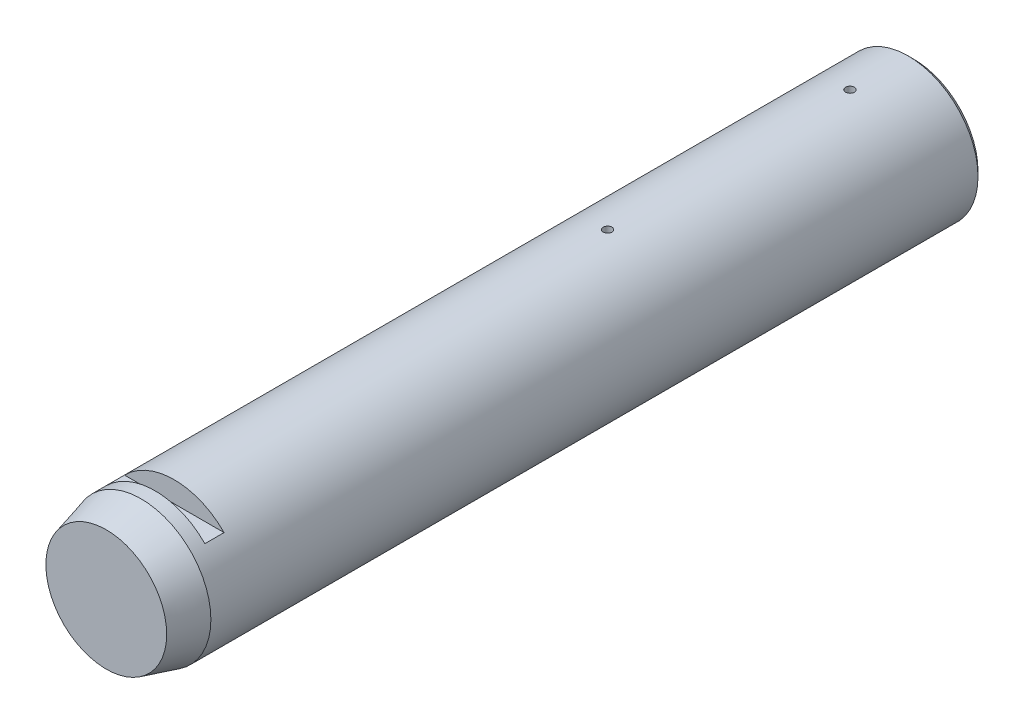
ISO-10303-21;
HEADER;
FILE_DESCRIPTION(('STEP AP214'),'2;1');
FILE_NAME('part.step','',(''),(''),'','','');
FILE_SCHEMA(('AUTOMOTIVE_DESIGN { 1 0 10303 214 1 1 1 1 }'));
ENDSEC;
DATA;
#1=APPLICATION_CONTEXT('core data for automotive mechanical design processes');
#2=APPLICATION_PROTOCOL_DEFINITION('international standard','automotive_design',2000,#1);
#3=PRODUCT_CONTEXT('',#1,'mechanical');
#4=PRODUCT('Part','Part','',(#3));
#5=PRODUCT_RELATED_PRODUCT_CATEGORY('part','',(#4));
#6=PRODUCT_DEFINITION_FORMATION('','',#4);
#7=PRODUCT_DEFINITION_CONTEXT('part definition',#1,'design');
#8=PRODUCT_DEFINITION('design','',#6,#7);
#9=PRODUCT_DEFINITION_SHAPE('','',#8);
#10=(LENGTH_UNIT() NAMED_UNIT(*) SI_UNIT(.MILLI.,.METRE.));
#11=(NAMED_UNIT(*) PLANE_ANGLE_UNIT() SI_UNIT($,.RADIAN.));
#12=(NAMED_UNIT(*) SI_UNIT($,.STERADIAN.) SOLID_ANGLE_UNIT());
#13=UNCERTAINTY_MEASURE_WITH_UNIT(LENGTH_MEASURE(1.E-05),#10,'distance_accuracy_value','');
#14=(GEOMETRIC_REPRESENTATION_CONTEXT(3) GLOBAL_UNCERTAINTY_ASSIGNED_CONTEXT((#13)) GLOBAL_UNIT_ASSIGNED_CONTEXT((#10,
#11,#12)) REPRESENTATION_CONTEXT('',''));
#15=CARTESIAN_POINT('',(0.,0.,0.));
#16=DIRECTION('',(0.,0.,1.));
#17=DIRECTION('',(1.,0.,0.));
#18=AXIS2_PLACEMENT_3D('',#15,#16,#17);
#19=CARTESIAN_POINT('',(0.,0.,463.));
#20=DIRECTION('',(0.,0.,-1.));
#21=DIRECTION('',(-1.,0.,0.));
#22=AXIS2_PLACEMENT_3D('',#19,#20,#21);
#23=CYLINDRICAL_SURFACE('',#22,40.);
#24=CARTESIAN_POINT('',(0.,0.,2.99999999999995));
#25=DIRECTION('',(0.,0.,1.));
#26=DIRECTION('',(1.,0.,0.));
#27=AXIS2_PLACEMENT_3D('',#24,#25,#26);
#28=CIRCLE('',#27,40.);
#29=CARTESIAN_POINT('',(40.,0.,2.99999999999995));
#30=VERTEX_POINT('',#29);
#31=EDGE_CURVE('E93',#30,#30,#28,.T.);
#32=ORIENTED_EDGE('',*,*,#31,.T.);
#33=EDGE_LOOP('',(#32));
#34=FACE_BOUND('',#33,.T.);
#35=CARTESIAN_POINT('',(0.,0.,443.));
#36=DIRECTION('',(0.,0.,1.));
#37=DIRECTION('',(1.,0.,0.));
#38=AXIS2_PLACEMENT_3D('',#35,#36,#37);
#39=CIRCLE('',#38,40.);
#40=CARTESIAN_POINT('',(40.,0.,443.));
#41=VERTEX_POINT('',#40);
#42=EDGE_CURVE('E84',#41,#41,#39,.F.);
#43=ORIENTED_EDGE('',*,*,#42,.T.);
#44=EDGE_LOOP('',(#43));
#45=FACE_BOUND('',#44,.T.);
#46=CARTESIAN_POINT('',(0.,40.,39.));
#47=CARTESIAN_POINT('',(0.140279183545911,39.9999989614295,38.9999938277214));
#48=CARTESIAN_POINT('',(0.280656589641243,39.999254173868,38.9881533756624));
#49=CARTESIAN_POINT('',(0.557535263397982,39.9963546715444,38.9410894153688));
#50=CARTESIAN_POINT('',(0.694031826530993,39.9941983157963,38.9058386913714));
#51=CARTESIAN_POINT('',(0.959098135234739,39.9887196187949,38.8129706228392));
#52=CARTESIAN_POINT('',(1.0876720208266,39.9853978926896,38.7553650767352));
#53=CARTESIAN_POINT('',(1.33329176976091,39.9779620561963,38.6194416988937));
#54=CARTESIAN_POINT('',(1.45034026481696,39.9738481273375,38.5411286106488));
#55=CARTESIAN_POINT('',(1.66979557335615,39.9652834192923,38.3658846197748));
#56=CARTESIAN_POINT('',(1.77218285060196,39.9608322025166,38.2689292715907));
#57=CARTESIAN_POINT('',(1.95924226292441,39.9520983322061,38.0592033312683));
#58=CARTESIAN_POINT('',(2.04391365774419,39.9478156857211,37.9464320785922));
#59=CARTESIAN_POINT('',(2.19319796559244,39.9398985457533,37.7081648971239));
#60=CARTESIAN_POINT('',(2.25779465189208,39.9362645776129,37.5826587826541));
#61=CARTESIAN_POINT('',(2.36499204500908,39.9300602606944,37.3225559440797));
#62=CARTESIAN_POINT('',(2.4075929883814,39.9274899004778,37.1879593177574));
#63=CARTESIAN_POINT('',(2.46953539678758,39.9237068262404,36.9136843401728));
#64=CARTESIAN_POINT('',(2.48890746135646,39.922492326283,36.774012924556));
#65=CARTESIAN_POINT('',(2.50393666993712,39.9215525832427,36.4933959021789));
#66=CARTESIAN_POINT('',(2.49959408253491,39.921827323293,36.3524503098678));
#67=CARTESIAN_POINT('',(2.46734265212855,39.923833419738,36.0734943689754));
#68=CARTESIAN_POINT('',(2.43946692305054,39.925562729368,35.9354801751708));
#69=CARTESIAN_POINT('',(2.36099186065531,39.9302798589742,35.666093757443));
#70=CARTESIAN_POINT('',(2.31039239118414,39.933267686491,35.5347215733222));
#71=CARTESIAN_POINT('',(2.18786859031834,39.9401674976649,35.2822419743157));
#72=CARTESIAN_POINT('',(2.11592923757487,39.9440801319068,35.1611418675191));
#73=CARTESIAN_POINT('',(1.95277865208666,39.9523879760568,34.9327239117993));
#74=CARTESIAN_POINT('',(1.8615672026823,39.9567831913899,34.8254062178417));
#75=CARTESIAN_POINT('',(1.66227507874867,39.9655699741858,34.6274067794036));
#76=CARTESIAN_POINT('',(1.55416574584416,39.9699615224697,34.5367538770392));
#77=CARTESIAN_POINT('',(1.32424715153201,39.9782388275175,34.3748797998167));
#78=CARTESIAN_POINT('',(1.20243788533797,39.9821245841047,34.3036586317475));
#79=CARTESIAN_POINT('',(0.948559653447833,39.9889527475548,34.1826721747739));
#80=CARTESIAN_POINT('',(0.816490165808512,39.9918951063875,34.1329079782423));
#81=CARTESIAN_POINT('',(0.545848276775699,39.9965042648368,34.0562673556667));
#82=CARTESIAN_POINT('',(0.407275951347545,39.9981710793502,34.0293906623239));
#83=CARTESIAN_POINT('',(0.127812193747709,40.0000394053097,33.9993237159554));
#84=CARTESIAN_POINT('',(-0.013074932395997,40.0002433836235,33.9960935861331));
#85=CARTESIAN_POINT('',(-0.29338901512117,39.999169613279,34.0133072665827));
#86=CARTESIAN_POINT('',(-0.43281597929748,39.9978918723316,34.0337509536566));
#87=CARTESIAN_POINT('',(-0.706139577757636,39.994000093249,34.0976989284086));
#88=CARTESIAN_POINT('',(-0.840040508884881,39.9913871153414,34.1411849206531));
#89=CARTESIAN_POINT('',(-1.09864370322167,39.985118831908,34.2499645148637));
#90=CARTESIAN_POINT('',(-1.22334588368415,39.9814635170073,34.3152583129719));
#91=CARTESIAN_POINT('',(-1.46019434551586,39.9735151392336,34.4659015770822));
#92=CARTESIAN_POINT('',(-1.5723236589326,39.9692212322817,34.551277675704));
#93=CARTESIAN_POINT('',(-1.78067263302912,39.9604817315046,34.7396232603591));
#94=CARTESIAN_POINT('',(-1.87689213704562,39.9560361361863,34.8425929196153));
#95=CARTESIAN_POINT('',(-2.05082525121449,39.9474871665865,35.0633747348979));
#96=CARTESIAN_POINT('',(-2.12851299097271,39.9433842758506,35.1812072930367));
#97=CARTESIAN_POINT('',(-2.26300034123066,39.9359911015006,35.4282675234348));
#98=CARTESIAN_POINT('',(-2.3198000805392,39.9327008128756,35.5574951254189));
#99=CARTESIAN_POINT('',(-2.41085429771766,39.9273073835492,35.8235826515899));
#100=CARTESIAN_POINT('',(-2.44512505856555,39.9252033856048,35.9604369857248));
#101=CARTESIAN_POINT('',(-2.49020167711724,39.9224174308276,36.2379708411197));
#102=CARTESIAN_POINT('',(-2.50100776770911,39.9217354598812,36.3786503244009));
#103=CARTESIAN_POINT('',(-2.49884605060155,39.9218708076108,36.6595838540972));
#104=CARTESIAN_POINT('',(-2.48591891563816,39.9226855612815,36.7998382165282));
#105=CARTESIAN_POINT('',(-2.43674202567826,39.9257171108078,37.0761807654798));
#106=CARTESIAN_POINT('',(-2.4004922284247,39.9279339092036,37.2122689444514));
#107=CARTESIAN_POINT('',(-2.30570815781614,39.9335191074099,37.4764222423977));
#108=CARTESIAN_POINT('',(-2.24717404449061,39.9368874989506,37.60448741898));
#109=CARTESIAN_POINT('',(-2.10948852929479,39.9443962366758,37.8489777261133));
#110=CARTESIAN_POINT('',(-2.03033766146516,39.9485365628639,37.9654031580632));
#111=CARTESIAN_POINT('',(-1.85351514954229,39.9571308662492,38.1835152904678));
#112=CARTESIAN_POINT('',(-1.75581411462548,39.9615853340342,38.2851781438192));
#113=CARTESIAN_POINT('',(-1.54470387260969,39.97030180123,38.4706947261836));
#114=CARTESIAN_POINT('',(-1.43129082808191,39.9745637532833,38.5545440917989));
#115=CARTESIAN_POINT('',(-1.19184681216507,39.9824193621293,38.7021152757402));
#116=CARTESIAN_POINT('',(-1.06580040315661,39.9860121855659,38.765812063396));
#117=CARTESIAN_POINT('',(-0.804871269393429,39.992113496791,38.8710605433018));
#118=CARTESIAN_POINT('',(-0.669999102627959,39.9946232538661,38.9126381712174));
#119=CARTESIAN_POINT('',(-0.445251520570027,39.9976179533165,38.9616618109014));
#120=CARTESIAN_POINT('',(-0.356828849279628,39.9985072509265,38.9760200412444));
#121=CARTESIAN_POINT('',(-0.17895077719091,39.9996986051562,38.9951910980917));
#122=CARTESIAN_POINT('',(-0.0894953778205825,40.0000006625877,39.0000039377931));
#123=CARTESIAN_POINT('',(0.,40.,39.));
#124=B_SPLINE_CURVE_WITH_KNOTS('',3,(#46,#47,#48,#49,#50,#51,#52,#53,#54,#55,#56,#57,#58,#59,
#60,#61,#62,#63,#64,#65,#66,#67,#68,#69,#70,#71,#72,#73,#74,#75,#76,#77,#78,#79,#80,#81,#82,#83,
#84,#85,#86,#87,#88,#89,#90,#91,#92,#93,#94,#95,#96,#97,#98,#99,#100,#101,#102,#103,#104,#105,
#106,#107,#108,#109,#110,#111,#112,#113,#114,#115,#116,#117,#118,#119,#120,#121,#122,#123),
.UNSPECIFIED.,.T.,.F.,(4,2,2,2,2,2,2,2,2,2,2,2,2,2,2,2,2,2,2,2,2,2,2,2,2,2,2,2,2,2,2,2,2,2,2,2,
2,2,4),(0.,0.420510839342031,0.841511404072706,1.26229007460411,1.68297244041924,
2.10421025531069,2.52546566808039,2.94706070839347,3.36865121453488,3.78968574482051,
4.21071550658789,4.63115381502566,5.05159464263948,5.47233212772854,5.89307434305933,
6.3145380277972,6.73600185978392,7.15748714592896,7.57896750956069,7.99973693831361,
8.42050417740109,8.84093782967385,9.26137526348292,9.68237344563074,10.1033757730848,
10.5249624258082,10.9465464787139,11.3678254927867,11.7891003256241,12.2096538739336,
12.630208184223,13.0507594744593,13.4712998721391,13.8925122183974,14.3138276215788,
14.7356642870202,15.1570052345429,15.4252833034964,15.6935610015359),.UNSPECIFIED.);
#125=CARTESIAN_POINT('',(0.,40.,39.));
#126=VERTEX_POINT('',#125);
#127=EDGE_CURVE('E114',#126,#126,#124,.T.);
#128=ORIENTED_EDGE('',*,*,#127,.F.);
#129=EDGE_LOOP('',(#128));
#130=FACE_BOUND('',#129,.T.);
#131=CARTESIAN_POINT('',(0.,40.,178.));
#132=CARTESIAN_POINT('',(0.140279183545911,39.9999989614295,177.999993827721));
#133=CARTESIAN_POINT('',(0.280656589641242,39.999254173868,177.988153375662));
#134=CARTESIAN_POINT('',(0.55753526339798,39.9963546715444,177.941089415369));
#135=CARTESIAN_POINT('',(0.694031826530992,39.9941983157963,177.905838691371));
#136=CARTESIAN_POINT('',(0.959098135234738,39.9887196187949,177.812970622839));
#137=CARTESIAN_POINT('',(1.0876720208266,39.9853978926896,177.755365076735));
#138=CARTESIAN_POINT('',(1.33329176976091,39.9779620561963,177.619441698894));
#139=CARTESIAN_POINT('',(1.45034026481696,39.9738481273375,177.541128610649));
#140=CARTESIAN_POINT('',(1.66979557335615,39.9652834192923,177.365884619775));
#141=CARTESIAN_POINT('',(1.77218285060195,39.9608322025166,177.268929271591));
#142=CARTESIAN_POINT('',(1.9592422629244,39.9520983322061,177.059203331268));
#143=CARTESIAN_POINT('',(2.04391365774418,39.9478156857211,176.946432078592));
#144=CARTESIAN_POINT('',(2.19319796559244,39.9398985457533,176.708164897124));
#145=CARTESIAN_POINT('',(2.25779465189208,39.9362645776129,176.582658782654));
#146=CARTESIAN_POINT('',(2.36499204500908,39.9300602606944,176.32255594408));
#147=CARTESIAN_POINT('',(2.4075929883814,39.9274899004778,176.187959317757));
#148=CARTESIAN_POINT('',(2.46953539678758,39.9237068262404,175.913684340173));
#149=CARTESIAN_POINT('',(2.48890746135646,39.922492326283,175.774012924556));
#150=CARTESIAN_POINT('',(2.50393666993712,39.9215525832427,175.493395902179));
#151=CARTESIAN_POINT('',(2.4995940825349,39.921827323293,175.352450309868));
#152=CARTESIAN_POINT('',(2.46734265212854,39.923833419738,175.073494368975));
#153=CARTESIAN_POINT('',(2.43946692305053,39.925562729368,174.935480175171));
#154=CARTESIAN_POINT('',(2.3609918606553,39.9302798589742,174.666093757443));
#155=CARTESIAN_POINT('',(2.31039239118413,39.933267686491,174.534721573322));
#156=CARTESIAN_POINT('',(2.18786859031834,39.9401674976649,174.282241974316));
#157=CARTESIAN_POINT('',(2.11592923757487,39.9440801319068,174.161141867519));
#158=CARTESIAN_POINT('',(1.95277865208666,39.9523879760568,173.932723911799));
#159=CARTESIAN_POINT('',(1.8615672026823,39.9567831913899,173.825406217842));
#160=CARTESIAN_POINT('',(1.66227507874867,39.9655699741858,173.627406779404));
#161=CARTESIAN_POINT('',(1.55416574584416,39.9699615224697,173.536753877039));
#162=CARTESIAN_POINT('',(1.32424715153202,39.9782388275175,173.374879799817));
#163=CARTESIAN_POINT('',(1.20243788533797,39.9821245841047,173.303658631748));
#164=CARTESIAN_POINT('',(0.94855965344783,39.9889527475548,173.182672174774));
#165=CARTESIAN_POINT('',(0.81649016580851,39.9918951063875,173.132907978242));
#166=CARTESIAN_POINT('',(0.545848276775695,39.9965042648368,173.056267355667));
#167=CARTESIAN_POINT('',(0.407275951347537,39.9981710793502,173.029390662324));
#168=CARTESIAN_POINT('',(0.127812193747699,40.0000394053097,172.999323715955));
#169=CARTESIAN_POINT('',(-0.013074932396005,40.0002433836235,172.996093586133));
#170=CARTESIAN_POINT('',(-0.293389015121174,39.999169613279,173.013307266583));
#171=CARTESIAN_POINT('',(-0.432815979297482,39.9978918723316,173.033750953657));
#172=CARTESIAN_POINT('',(-0.706139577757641,39.994000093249,173.097698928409));
#173=CARTESIAN_POINT('',(-0.840040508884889,39.9913871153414,173.141184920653));
#174=CARTESIAN_POINT('',(-1.09864370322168,39.985118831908,173.249964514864));
#175=CARTESIAN_POINT('',(-1.22334588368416,39.9814635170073,173.315258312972));
#176=CARTESIAN_POINT('',(-1.46019434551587,39.9735151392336,173.465901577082));
#177=CARTESIAN_POINT('',(-1.5723236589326,39.9692212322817,173.551277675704));
#178=CARTESIAN_POINT('',(-1.78067263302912,39.9604817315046,173.739623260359));
#179=CARTESIAN_POINT('',(-1.87689213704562,39.9560361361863,173.842592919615));
#180=CARTESIAN_POINT('',(-2.0508252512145,39.9474871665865,174.063374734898));
#181=CARTESIAN_POINT('',(-2.12851299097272,39.9433842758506,174.181207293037));
#182=CARTESIAN_POINT('',(-2.26300034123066,39.9359911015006,174.428267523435));
#183=CARTESIAN_POINT('',(-2.3198000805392,39.9327008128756,174.557495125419));
#184=CARTESIAN_POINT('',(-2.41085429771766,39.9273073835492,174.82358265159));
#185=CARTESIAN_POINT('',(-2.44512505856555,39.9252033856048,174.960436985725));
#186=CARTESIAN_POINT('',(-2.49020167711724,39.9224174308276,175.23797084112));
#187=CARTESIAN_POINT('',(-2.50100776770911,39.9217354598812,175.378650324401));
#188=CARTESIAN_POINT('',(-2.49884605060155,39.9218708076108,175.659583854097));
#189=CARTESIAN_POINT('',(-2.48591891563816,39.9226855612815,175.799838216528));
#190=CARTESIAN_POINT('',(-2.43674202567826,39.9257171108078,176.07618076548));
#191=CARTESIAN_POINT('',(-2.40049222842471,39.9279339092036,176.212268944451));
#192=CARTESIAN_POINT('',(-2.30570815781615,39.9335191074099,176.476422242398));
#193=CARTESIAN_POINT('',(-2.24717404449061,39.9368874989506,176.60448741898));
#194=CARTESIAN_POINT('',(-2.10948852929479,39.9443962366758,176.848977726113));
#195=CARTESIAN_POINT('',(-2.03033766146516,39.9485365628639,176.965403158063));
#196=CARTESIAN_POINT('',(-1.85351514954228,39.9571308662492,177.183515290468));
#197=CARTESIAN_POINT('',(-1.75581411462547,39.9615853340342,177.285178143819));
#198=CARTESIAN_POINT('',(-1.54470387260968,39.97030180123,177.470694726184));
#199=CARTESIAN_POINT('',(-1.4312908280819,39.9745637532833,177.554544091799));
#200=CARTESIAN_POINT('',(-1.19184681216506,39.9824193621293,177.70211527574));
#201=CARTESIAN_POINT('',(-1.06580040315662,39.9860121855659,177.765812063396));
#202=CARTESIAN_POINT('',(-0.804871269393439,39.992113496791,177.871060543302));
#203=CARTESIAN_POINT('',(-0.669999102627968,39.9946232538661,177.912638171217));
#204=CARTESIAN_POINT('',(-0.445251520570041,39.9976179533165,177.961661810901));
#205=CARTESIAN_POINT('',(-0.356828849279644,39.9985072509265,177.976020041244));
#206=CARTESIAN_POINT('',(-0.178950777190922,39.9996986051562,177.995191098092));
#207=CARTESIAN_POINT('',(-0.0894953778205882,40.0000006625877,178.000003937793));
#208=CARTESIAN_POINT('',(0.,40.,178.));
#209=B_SPLINE_CURVE_WITH_KNOTS('',3,(#131,#132,#133,#134,#135,#136,#137,#138,#139,#140,#141,
#142,#143,#144,#145,#146,#147,#148,#149,#150,#151,#152,#153,#154,#155,#156,#157,#158,#159,#160,
#161,#162,#163,#164,#165,#166,#167,#168,#169,#170,#171,#172,#173,#174,#175,#176,#177,#178,#179,
#180,#181,#182,#183,#184,#185,#186,#187,#188,#189,#190,#191,#192,#193,#194,#195,#196,#197,#198,
#199,#200,#201,#202,#203,#204,#205,#206,#207,#208),.UNSPECIFIED.,.T.,.F.,(4,2,2,2,2,2,2,2,2,2,2,
2,2,2,2,2,2,2,2,2,2,2,2,2,2,2,2,2,2,2,2,2,2,2,2,2,2,2,4),(0.,0.420510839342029,
0.841511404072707,1.2622900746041,1.68297244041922,2.10421025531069,2.52546566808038,
2.94706070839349,3.36865121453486,3.78968574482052,4.21071550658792,4.63115381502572,
5.0515946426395,5.47233212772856,5.89307434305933,6.31453802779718,6.73600185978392,
7.15748714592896,7.5789675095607,7.99973693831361,8.42050417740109,8.84093782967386,
9.26137526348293,9.68237344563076,10.1033757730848,10.5249624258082,10.9465464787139,
11.3678254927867,11.7891003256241,12.2096538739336,12.630208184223,13.0507594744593,
13.4712998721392,13.8925122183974,14.3138276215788,14.7356642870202,15.1570052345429,
15.4252833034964,15.6935610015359),.UNSPECIFIED.);
#210=CARTESIAN_POINT('',(0.,40.,178.));
#211=VERTEX_POINT('',#210);
#212=EDGE_CURVE('E122',#211,#211,#209,.T.);
#213=ORIENTED_EDGE('',*,*,#212,.F.);
#214=EDGE_LOOP('',(#213));
#215=FACE_BOUND('',#214,.T.);
#216=DIRECTION('',(0.,0.,-1.));
#217=VECTOR('',#216,1.);
#218=CARTESIAN_POINT('',(28.5657137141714,28.,463.));
#219=LINE('',#218,#217);
#220=CARTESIAN_POINT('',(28.5657137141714,28.,435.));
#221=VERTEX_POINT('',#220);
#222=CARTESIAN_POINT('',(28.5657137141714,28.,424.));
#223=VERTEX_POINT('',#222);
#224=EDGE_CURVE('E11',#221,#223,#219,.T.);
#225=ORIENTED_EDGE('',*,*,#224,.F.);
#226=CARTESIAN_POINT('',(0.,0.,435.));
#227=DIRECTION('',(0.,0.,-1.));
#228=DIRECTION('',(-1.,0.,0.));
#229=AXIS2_PLACEMENT_3D('',#226,#227,#228);
#230=CIRCLE('',#229,40.);
#231=CARTESIAN_POINT('',(-28.5657137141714,28.,435.));
#232=VERTEX_POINT('',#231);
#233=EDGE_CURVE('E68',#232,#221,#230,.T.);
#234=ORIENTED_EDGE('',*,*,#233,.F.);
#235=DIRECTION('',(0.,0.,-1.));
#236=VECTOR('',#235,1.);
#237=CARTESIAN_POINT('',(-28.5657137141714,28.,463.));
#238=LINE('',#237,#236);
#239=CARTESIAN_POINT('',(-28.5657137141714,28.,424.));
#240=VERTEX_POINT('',#239);
#241=EDGE_CURVE('E75',#240,#232,#238,.F.);
#242=ORIENTED_EDGE('',*,*,#241,.F.);
#243=CARTESIAN_POINT('',(0.,0.,424.));
#244=DIRECTION('',(0.,0.,1.));
#245=DIRECTION('',(1.,0.,0.));
#246=AXIS2_PLACEMENT_3D('',#243,#244,#245);
#247=CIRCLE('',#246,40.);
#248=EDGE_CURVE('E42',#223,#240,#247,.T.);
#249=ORIENTED_EDGE('',*,*,#248,.F.);
#250=EDGE_LOOP('',(#225,#234,#242,#249));
#251=FACE_BOUND('',#250,.T.);
#252=ADVANCED_FACE('F34',(#34,#45,#130,#215,#251),#23,.T.);
#253=CARTESIAN_POINT('',(0.,0.,463.));
#254=DIRECTION('',(0.,0.,1.));
#255=DIRECTION('',(1.,0.,0.));
#256=AXIS2_PLACEMENT_3D('',#253,#254,#255);
#257=PLANE('',#256);
#258=CARTESIAN_POINT('',(0.,0.,463.));
#259=DIRECTION('',(0.,0.,1.));
#260=DIRECTION('',(1.,0.,0.));
#261=AXIS2_PLACEMENT_3D('',#258,#259,#260);
#262=CIRCLE('',#261,34.6410161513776);
#263=CARTESIAN_POINT('',(34.6410161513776,0.,463.));
#264=VERTEX_POINT('',#263);
#265=EDGE_CURVE('E87',#264,#264,#262,.T.);
#266=ORIENTED_EDGE('',*,*,#265,.T.);
#267=EDGE_LOOP('',(#266));
#268=FACE_BOUND('',#267,.T.);
#269=ADVANCED_FACE('F155',(#268),#257,.T.);
#270=CARTESIAN_POINT('',(0.,0.,0.));
#271=DIRECTION('',(0.,0.,1.));
#272=DIRECTION('',(1.,0.,0.));
#273=AXIS2_PLACEMENT_3D('',#270,#271,#272);
#274=PLANE('',#273);
#275=CARTESIAN_POINT('',(25.,0.,0.));
#276=DIRECTION('',(0.,0.,-1.));
#277=DIRECTION('',(-1.,0.,0.));
#278=AXIS2_PLACEMENT_3D('',#275,#276,#277);
#279=CIRCLE('',#278,3.39999999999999);
#280=CARTESIAN_POINT('',(21.6,0.,0.));
#281=VERTEX_POINT('',#280);
#282=EDGE_CURVE('E108',#281,#281,#279,.T.);
#283=ORIENTED_EDGE('',*,*,#282,.F.);
#284=EDGE_LOOP('',(#283));
#285=FACE_BOUND('',#284,.T.);
#286=CARTESIAN_POINT('',(-25.,0.,0.));
#287=DIRECTION('',(0.,0.,-1.));
#288=DIRECTION('',(-1.,0.,0.));
#289=AXIS2_PLACEMENT_3D('',#286,#287,#288);
#290=CIRCLE('',#289,3.39999999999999);
#291=CARTESIAN_POINT('',(-28.4,0.,0.));
#292=VERTEX_POINT('',#291);
#293=EDGE_CURVE('E102',#292,#292,#290,.T.);
#294=ORIENTED_EDGE('',*,*,#293,.F.);
#295=EDGE_LOOP('',(#294));
#296=FACE_BOUND('',#295,.T.);
#297=CARTESIAN_POINT('',(0.,0.,0.));
#298=DIRECTION('',(0.,0.,-1.));
#299=DIRECTION('',(-1.,0.,0.));
#300=AXIS2_PLACEMENT_3D('',#297,#298,#299);
#301=CIRCLE('',#300,3.4);
#302=CARTESIAN_POINT('',(-3.4,0.,0.));
#303=VERTEX_POINT('',#302);
#304=EDGE_CURVE('E96',#303,#303,#301,.T.);
#305=ORIENTED_EDGE('',*,*,#304,.F.);
#306=EDGE_LOOP('',(#305));
#307=FACE_BOUND('',#306,.T.);
#308=CARTESIAN_POINT('',(0.,0.,0.));
#309=DIRECTION('',(0.,0.,1.));
#310=DIRECTION('',(1.,0.,0.));
#311=AXIS2_PLACEMENT_3D('',#308,#309,#310);
#312=CIRCLE('',#311,37.);
#313=CARTESIAN_POINT('',(37.,0.,0.));
#314=VERTEX_POINT('',#313);
#315=EDGE_CURVE('E90',#314,#314,#312,.F.);
#316=ORIENTED_EDGE('',*,*,#315,.T.);
#317=EDGE_LOOP('',(#316));
#318=FACE_BOUND('',#317,.T.);
#319=ADVANCED_FACE('F161',(#285,#296,#307,#318),#274,.F.);
#320=CARTESIAN_POINT('',(0.,0.,2.99999999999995));
#321=DIRECTION('',(0.,0.,1.));
#322=DIRECTION('',(1.,0.,0.));
#323=AXIS2_PLACEMENT_3D('',#320,#321,#322);
#324=CONICAL_SURFACE('',#323,40.,0.785398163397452);
#325=ORIENTED_EDGE('',*,*,#315,.F.);
#326=EDGE_LOOP('',(#325));
#327=FACE_BOUND('',#326,.T.);
#328=ORIENTED_EDGE('',*,*,#31,.F.);
#329=EDGE_LOOP('',(#328));
#330=FACE_BOUND('',#329,.T.);
#331=ADVANCED_FACE('F166',(#327,#330),#324,.T.);
#332=CARTESIAN_POINT('',(0.,0.,463.));
#333=DIRECTION('',(0.,0.,-1.));
#334=DIRECTION('',(-1.,0.,0.));
#335=AXIS2_PLACEMENT_3D('',#332,#333,#334);
#336=CONICAL_SURFACE('',#335,34.6410161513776,0.261799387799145);
#337=ORIENTED_EDGE('',*,*,#42,.F.);
#338=EDGE_LOOP('',(#337));
#339=FACE_BOUND('',#338,.T.);
#340=ORIENTED_EDGE('',*,*,#265,.F.);
#341=EDGE_LOOP('',(#340));
#342=FACE_BOUND('',#341,.T.);
#343=ADVANCED_FACE('F36',(#339,#342),#336,.T.);
#344=CARTESIAN_POINT('',(0.,0.,0.));
#345=DIRECTION('',(0.,0.,-1.));
#346=DIRECTION('',(-1.,0.,0.));
#347=AXIS2_PLACEMENT_3D('',#344,#345,#346);
#348=CYLINDRICAL_SURFACE('',#347,3.39999999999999);
#349=CARTESIAN_POINT('',(0.,3.39999999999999,178.));
#350=CARTESIAN_POINT('',(-0.122639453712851,3.39999211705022,177.999991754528));
#351=CARTESIAN_POINT('',(-0.245474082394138,3.39329422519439,177.990903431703));
#352=CARTESIAN_POINT('',(-0.487295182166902,3.36710883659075,177.955110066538));
#353=CARTESIAN_POINT('',(-0.60627141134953,3.34758982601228,177.928361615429));
#354=CARTESIAN_POINT('',(-0.836236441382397,3.29764692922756,177.859035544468));
#355=CARTESIAN_POINT('',(-0.947268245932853,3.26728809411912,177.81655229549));
#356=CARTESIAN_POINT('',(-1.15993305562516,3.19798086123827,177.717728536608));
#357=CARTESIAN_POINT('',(-1.26156871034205,3.15903489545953,177.661391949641));
#358=CARTESIAN_POINT('',(-1.46316688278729,3.07120651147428,177.530973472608));
#359=CARTESIAN_POINT('',(-1.56212445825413,3.02174084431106,177.455739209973));
#360=CARTESIAN_POINT('',(-1.74687761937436,2.91884038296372,177.292661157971));
#361=CARTESIAN_POINT('',(-1.83265221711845,2.8653994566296,177.204797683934));
#362=CARTESIAN_POINT('',(-2.00584127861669,2.74764820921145,176.999348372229));
#363=CARTESIAN_POINT('',(-2.09030333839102,2.68325377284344,176.87930920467));
#364=CARTESIAN_POINT('',(-2.23808911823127,2.56126897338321,176.623692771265));
#365=CARTESIAN_POINT('',(-2.30144395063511,2.50366867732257,176.488138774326));
#366=CARTESIAN_POINT('',(-2.38689317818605,2.42177824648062,176.250278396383));
#367=CARTESIAN_POINT('',(-2.41570030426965,2.39279122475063,176.152022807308));
#368=CARTESIAN_POINT('',(-2.46127545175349,2.34589081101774,175.95029640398));
#369=CARTESIAN_POINT('',(-2.47807066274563,2.32795242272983,175.846837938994));
#370=CARTESIAN_POINT('',(-2.49853712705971,2.30598492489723,175.636251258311));
#371=CARTESIAN_POINT('',(-2.50210457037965,2.30206584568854,175.529100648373));
#372=CARTESIAN_POINT('',(-2.49548631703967,2.30923389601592,175.315704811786));
#373=CARTESIAN_POINT('',(-2.48529149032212,2.32033098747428,175.20946023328));
#374=CARTESIAN_POINT('',(-2.45025865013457,2.35731223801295,174.990243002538));
#375=CARTESIAN_POINT('',(-2.42397761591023,2.3846445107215,174.877757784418));
#376=CARTESIAN_POINT('',(-2.35752736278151,2.45035394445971,174.660322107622));
#377=CARTESIAN_POINT('',(-2.31732519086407,2.48875727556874,174.555390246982));
#378=CARTESIAN_POINT('',(-2.20817362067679,2.58670600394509,174.318248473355));
#379=CARTESIAN_POINT('',(-2.13408574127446,2.64892441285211,174.189521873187));
#380=CARTESIAN_POINT('',(-1.96541442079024,2.77639571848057,173.947944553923));
#381=CARTESIAN_POINT('',(-1.87080729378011,2.84165205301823,173.835112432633));
#382=CARTESIAN_POINT('',(-1.66053554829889,2.96951145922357,173.625166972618));
#383=CARTESIAN_POINT('',(-1.54458449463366,3.03206209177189,173.528306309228));
#384=CARTESIAN_POINT('',(-1.29383496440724,3.14720771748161,173.355460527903));
#385=CARTESIAN_POINT('',(-1.15908065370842,3.19982537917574,173.279427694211));
#386=CARTESIAN_POINT('',(-0.910038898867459,3.277843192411,173.168612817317));
#387=CARTESIAN_POINT('',(-0.799330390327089,3.30676259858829,173.128254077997));
#388=CARTESIAN_POINT('',(-0.571173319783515,3.35369681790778,173.063240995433));
#389=CARTESIAN_POINT('',(-0.453729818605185,3.37171970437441,173.038575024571));
#390=CARTESIAN_POINT('',(-0.214777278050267,3.39534010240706,173.00631665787));
#391=CARTESIAN_POINT('',(-0.0932539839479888,3.40088813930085,172.998792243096));
#392=CARTESIAN_POINT('',(0.14948695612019,3.39887934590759,173.001523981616));
#393=CARTESIAN_POINT('',(0.270704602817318,3.39132254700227,173.011780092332));
#394=CARTESIAN_POINT('',(0.5015414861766,3.3646886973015,173.048210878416));
#395=CARTESIAN_POINT('',(0.611413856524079,3.34635497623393,173.073359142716));
#396=CARTESIAN_POINT('',(0.824946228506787,3.30021328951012,173.137395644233));
#397=CARTESIAN_POINT('',(0.928604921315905,3.27240333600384,173.176286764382));
#398=CARTESIAN_POINT('',(1.13575967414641,3.20667581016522,173.269761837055));
#399=CARTESIAN_POINT('',(1.23860740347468,3.1681372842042,173.325336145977));
#400=CARTESIAN_POINT('',(1.433800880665,3.08472078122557,173.448763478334));
#401=CARTESIAN_POINT('',(1.52614025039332,3.03983899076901,173.516623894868));
#402=CARTESIAN_POINT('',(1.71556830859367,2.93775649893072,173.676571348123));
#403=CARTESIAN_POINT('',(1.81042690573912,2.8798054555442,173.770819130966));
#404=CARTESIAN_POINT('',(1.98392361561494,2.76314626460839,173.972970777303));
#405=CARTESIAN_POINT('',(2.06254606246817,2.70443744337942,174.080887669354));
#406=CARTESIAN_POINT('',(2.19589900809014,2.59704522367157,174.298844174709));
#407=CARTESIAN_POINT('',(2.25218527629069,2.54793871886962,174.407719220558));
#408=CARTESIAN_POINT('',(2.34909327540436,2.45888019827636,174.635692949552));
#409=CARTESIAN_POINT('',(2.38974747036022,2.41890928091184,174.754769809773));
#410=CARTESIAN_POINT('',(2.44570573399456,2.3621464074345,174.972715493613));
#411=CARTESIAN_POINT('',(2.46472040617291,2.3421158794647,175.069766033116));
#412=CARTESIAN_POINT('',(2.4911078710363,2.31403768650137,175.267085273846));
#413=CARTESIAN_POINT('',(2.49849904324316,2.30597110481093,175.367348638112));
#414=CARTESIAN_POINT('',(2.5010892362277,2.30316298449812,175.568486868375));
#415=CARTESIAN_POINT('',(2.49625726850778,2.3084553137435,175.6693626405));
#416=CARTESIAN_POINT('',(2.47473729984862,2.33150297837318,175.868422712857));
#417=CARTESIAN_POINT('',(2.45803313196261,2.34927530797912,175.966603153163));
#418=CARTESIAN_POINT('',(2.4076317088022,2.40102726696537,176.184948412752));
#419=CARTESIAN_POINT('',(2.37048076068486,2.43815587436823,176.303548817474));
#420=CARTESIAN_POINT('',(2.28076570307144,2.52227820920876,176.531091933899));
#421=CARTESIAN_POINT('',(2.22816100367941,2.56929782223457,176.640008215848));
#422=CARTESIAN_POINT('',(2.09242220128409,2.68170391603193,176.876672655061));
#423=CARTESIAN_POINT('',(2.00486499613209,2.74855334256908,177.001189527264));
#424=CARTESIAN_POINT('',(1.80860951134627,2.8814921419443,177.232602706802));
#425=CARTESIAN_POINT('',(1.69992245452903,2.9475818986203,177.339508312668));
#426=CARTESIAN_POINT('',(1.48079202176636,3.06269932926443,177.518421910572));
#427=CARTESIAN_POINT('',(1.37323039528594,3.11278398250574,177.593270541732));
#428=CARTESIAN_POINT('',(1.14477133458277,3.20383436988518,177.726413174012));
#429=CARTESIAN_POINT('',(1.02388820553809,3.24480974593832,177.784724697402));
#430=CARTESIAN_POINT('',(0.790378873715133,3.30872546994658,177.874551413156));
#431=CARTESIAN_POINT('',(0.67929367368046,3.33346106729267,177.908793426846));
#432=CARTESIAN_POINT('',(0.451743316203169,3.37181713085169,177.961602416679));
#433=CARTESIAN_POINT('',(0.335292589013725,3.3854657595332,177.980209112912));
#434=CARTESIAN_POINT('',(0.181701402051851,3.39533682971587,177.993654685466));
#435=CARTESIAN_POINT('',(0.145430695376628,3.39708256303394,177.996031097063));
#436=CARTESIAN_POINT('',(0.0727790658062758,3.39941539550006,177.99920508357));
#437=CARTESIAN_POINT('',(0.0363981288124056,3.40000233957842,178.000002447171));
#438=CARTESIAN_POINT('',(0.,3.39999999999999,178.));
#439=B_SPLINE_CURVE_WITH_KNOTS('',3,(#349,#350,#351,#352,#353,#354,#355,#356,#357,#358,#359,
#360,#361,#362,#363,#364,#365,#366,#367,#368,#369,#370,#371,#372,#373,#374,#375,#376,#377,#378,
#379,#380,#381,#382,#383,#384,#385,#386,#387,#388,#389,#390,#391,#392,#393,#394,#395,#396,#397,
#398,#399,#400,#401,#402,#403,#404,#405,#406,#407,#408,#409,#410,#411,#412,#413,#414,#415,#416,
#417,#418,#419,#420,#421,#422,#423,#424,#425,#426,#427,#428,#429,#430,#431,#432,#433,#434,#435,
#436,#437,#438),.UNSPECIFIED.,.T.,.F.,(4,2,2,2,2,2,2,2,2,2,2,2,2,2,2,2,2,2,2,2,2,2,2,2,2,2,2,2,
2,2,2,2,2,2,2,2,2,2,2,2,2,2,2,2,4),(0.,0.367759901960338,0.736427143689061,1.10291816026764,
1.46930551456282,1.86923413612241,2.26979301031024,2.74859419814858,3.22668647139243,
3.54481569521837,3.86222251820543,4.18211510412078,4.50222001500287,4.85639437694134,
5.21141290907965,5.69203322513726,6.17321131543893,6.66139257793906,7.14844590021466,
7.51094218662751,7.87316956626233,8.23683100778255,8.60049157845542,8.94160444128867,
9.28278890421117,9.65068970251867,10.0188126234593,10.4543889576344,10.8903836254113,
11.2851720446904,11.6791360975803,11.9806161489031,12.2816190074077,12.5833857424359,
12.8855641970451,13.2725600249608,13.6605815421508,14.1569278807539,14.6530113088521,
15.0722254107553,15.4909936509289,15.8460625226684,16.2002266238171,16.309359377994,
16.4185067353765),.UNSPECIFIED.);
#440=CARTESIAN_POINT('',(0.,3.39999999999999,178.));
#441=VERTEX_POINT('',#440);
#442=EDGE_CURVE('E78',#441,#441,#439,.T.);
#443=ORIENTED_EDGE('',*,*,#442,.F.);
#444=EDGE_LOOP('',(#443));
#445=FACE_BOUND('',#444,.T.);
#446=CARTESIAN_POINT('',(0.,3.39999999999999,39.));
#447=CARTESIAN_POINT('',(-0.122639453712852,3.39999211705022,38.9999917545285));
#448=CARTESIAN_POINT('',(-0.245474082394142,3.39329422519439,38.9909034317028));
#449=CARTESIAN_POINT('',(-0.487295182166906,3.36710883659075,38.9551100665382));
#450=CARTESIAN_POINT('',(-0.606271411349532,3.34758982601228,38.9283616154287));
#451=CARTESIAN_POINT('',(-0.836236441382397,3.29764692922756,38.8590355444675));
#452=CARTESIAN_POINT('',(-0.947268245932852,3.26728809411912,38.8165522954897));
#453=CARTESIAN_POINT('',(-1.15993305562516,3.19798086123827,38.7177285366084));
#454=CARTESIAN_POINT('',(-1.26156871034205,3.15903489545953,38.6613919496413));
#455=CARTESIAN_POINT('',(-1.46316688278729,3.07120651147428,38.5309734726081));
#456=CARTESIAN_POINT('',(-1.56212445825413,3.02174084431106,38.4557392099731));
#457=CARTESIAN_POINT('',(-1.74687761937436,2.91884038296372,38.2926611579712));
#458=CARTESIAN_POINT('',(-1.83265221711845,2.8653994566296,38.2047976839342));
#459=CARTESIAN_POINT('',(-2.00584127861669,2.74764820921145,37.999348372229));
#460=CARTESIAN_POINT('',(-2.09030333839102,2.68325377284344,37.8793092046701));
#461=CARTESIAN_POINT('',(-2.23808911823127,2.56126897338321,37.6236927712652));
#462=CARTESIAN_POINT('',(-2.30144395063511,2.50366867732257,37.4881387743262));
#463=CARTESIAN_POINT('',(-2.38689317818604,2.42177824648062,37.2502783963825));
#464=CARTESIAN_POINT('',(-2.41570030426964,2.39279122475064,37.1520228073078));
#465=CARTESIAN_POINT('',(-2.46127545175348,2.34589081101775,36.9502964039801));
#466=CARTESIAN_POINT('',(-2.47807066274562,2.32795242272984,36.846837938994));
#467=CARTESIAN_POINT('',(-2.49853712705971,2.30598492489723,36.6362512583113));
#468=CARTESIAN_POINT('',(-2.50210457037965,2.30206584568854,36.5291006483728));
#469=CARTESIAN_POINT('',(-2.49548631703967,2.30923389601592,36.3157048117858));
#470=CARTESIAN_POINT('',(-2.48529149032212,2.32033098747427,36.2094602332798));
#471=CARTESIAN_POINT('',(-2.45025865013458,2.35731223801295,35.9902430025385));
#472=CARTESIAN_POINT('',(-2.42397761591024,2.38464451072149,35.8777577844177));
#473=CARTESIAN_POINT('',(-2.35752736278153,2.45035394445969,35.6603221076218));
#474=CARTESIAN_POINT('',(-2.31732519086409,2.48875727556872,35.5553902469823));
#475=CARTESIAN_POINT('',(-2.20817362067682,2.58670600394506,35.3182484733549));
#476=CARTESIAN_POINT('',(-2.13408574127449,2.64892441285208,35.1895218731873));
#477=CARTESIAN_POINT('',(-1.96541442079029,2.77639571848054,34.9479445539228));
#478=CARTESIAN_POINT('',(-1.87080729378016,2.8416520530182,34.8351124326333));
#479=CARTESIAN_POINT('',(-1.66053554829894,2.96951145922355,34.6251669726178));
#480=CARTESIAN_POINT('',(-1.54458449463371,3.03206209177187,34.5283063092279));
#481=CARTESIAN_POINT('',(-1.29383496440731,3.14720771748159,34.3554605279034));
#482=CARTESIAN_POINT('',(-1.1590806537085,3.19982537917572,34.2794276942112));
#483=CARTESIAN_POINT('',(-0.910038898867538,3.27784319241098,34.1686128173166));
#484=CARTESIAN_POINT('',(-0.799330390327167,3.30676259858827,34.1282540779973));
#485=CARTESIAN_POINT('',(-0.571173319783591,3.35369681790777,34.0632409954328));
#486=CARTESIAN_POINT('',(-0.453729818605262,3.3717197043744,34.0385750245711));
#487=CARTESIAN_POINT('',(-0.214777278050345,3.39534010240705,34.0063166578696));
#488=CARTESIAN_POINT('',(-0.0932539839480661,3.40088813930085,33.9987922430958));
#489=CARTESIAN_POINT('',(0.149486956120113,3.39887934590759,34.0015239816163));
#490=CARTESIAN_POINT('',(0.270704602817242,3.39132254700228,34.0117800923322));
#491=CARTESIAN_POINT('',(0.501541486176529,3.36468869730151,34.0482108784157));
#492=CARTESIAN_POINT('',(0.61141385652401,3.34635497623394,34.0733591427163));
#493=CARTESIAN_POINT('',(0.824946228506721,3.30021328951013,34.1373956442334));
#494=CARTESIAN_POINT('',(0.928604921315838,3.27240333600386,34.1762867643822));
#495=CARTESIAN_POINT('',(1.13575967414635,3.20667581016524,34.2697618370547));
#496=CARTESIAN_POINT('',(1.23860740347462,3.16813728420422,34.3253361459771));
#497=CARTESIAN_POINT('',(1.43380088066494,3.0847207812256,34.4487634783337));
#498=CARTESIAN_POINT('',(1.52614025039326,3.03983899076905,34.516623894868));
#499=CARTESIAN_POINT('',(1.7155683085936,2.93775649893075,34.6765713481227));
#500=CARTESIAN_POINT('',(1.81042690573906,2.87980545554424,34.7708191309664));
#501=CARTESIAN_POINT('',(1.98392361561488,2.76314626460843,34.9729707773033));
#502=CARTESIAN_POINT('',(2.06254606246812,2.70443744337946,35.0808876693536));
#503=CARTESIAN_POINT('',(2.19589900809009,2.59704522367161,35.2988441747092));
#504=CARTESIAN_POINT('',(2.25218527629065,2.54793871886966,35.407719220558));
#505=CARTESIAN_POINT('',(2.34909327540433,2.45888019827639,35.6356929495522));
#506=CARTESIAN_POINT('',(2.38974747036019,2.41890928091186,35.7547698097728));
#507=CARTESIAN_POINT('',(2.44570573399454,2.36214640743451,35.9727154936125));
#508=CARTESIAN_POINT('',(2.4647204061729,2.34211587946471,36.0697660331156));
#509=CARTESIAN_POINT('',(2.4911078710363,2.31403768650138,36.2670852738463));
#510=CARTESIAN_POINT('',(2.49849904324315,2.30597110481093,36.3673486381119));
#511=CARTESIAN_POINT('',(2.5010892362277,2.30316298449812,36.5684868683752));
#512=CARTESIAN_POINT('',(2.49625726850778,2.30845531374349,36.6693626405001));
#513=CARTESIAN_POINT('',(2.47473729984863,2.33150297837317,36.8684227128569));
#514=CARTESIAN_POINT('',(2.45803313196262,2.34927530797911,36.9666031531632));
#515=CARTESIAN_POINT('',(2.40763170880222,2.40102726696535,37.1849484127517));
#516=CARTESIAN_POINT('',(2.37048076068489,2.43815587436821,37.3035488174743));
#517=CARTESIAN_POINT('',(2.28076570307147,2.52227820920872,37.5310919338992));
#518=CARTESIAN_POINT('',(2.22816100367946,2.56929782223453,37.6400082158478));
#519=CARTESIAN_POINT('',(2.09242220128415,2.68170391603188,37.8766726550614));
#520=CARTESIAN_POINT('',(2.00486499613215,2.74855334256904,38.0011895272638));
#521=CARTESIAN_POINT('',(1.80860951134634,2.88149214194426,38.2326027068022));
#522=CARTESIAN_POINT('',(1.6999224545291,2.94758189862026,38.3395083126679));
#523=CARTESIAN_POINT('',(1.48079202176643,3.0626993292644,38.5184219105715));
#524=CARTESIAN_POINT('',(1.37323039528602,3.11278398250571,38.5932705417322));
#525=CARTESIAN_POINT('',(1.14477133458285,3.20383436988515,38.7264131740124));
#526=CARTESIAN_POINT('',(1.02388820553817,3.2448097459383,38.7847246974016));
#527=CARTESIAN_POINT('',(0.790378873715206,3.30872546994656,38.8745514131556));
#528=CARTESIAN_POINT('',(0.679293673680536,3.33346106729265,38.9087934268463));
#529=CARTESIAN_POINT('',(0.451743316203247,3.37181713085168,38.9616024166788));
#530=CARTESIAN_POINT('',(0.335292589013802,3.38546575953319,38.9802091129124));
#531=CARTESIAN_POINT('',(0.181701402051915,3.39533682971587,38.9936546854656));
#532=CARTESIAN_POINT('',(0.145430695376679,3.39708256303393,38.9960310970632));
#533=CARTESIAN_POINT('',(0.0727790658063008,3.39941539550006,38.9992050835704));
#534=CARTESIAN_POINT('',(0.0363981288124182,3.40000233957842,39.0000024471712));
#535=CARTESIAN_POINT('',(0.,3.39999999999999,39.));
#536=B_SPLINE_CURVE_WITH_KNOTS('',3,(#446,#447,#448,#449,#450,#451,#452,#453,#454,#455,#456,
#457,#458,#459,#460,#461,#462,#463,#464,#465,#466,#467,#468,#469,#470,#471,#472,#473,#474,#475,
#476,#477,#478,#479,#480,#481,#482,#483,#484,#485,#486,#487,#488,#489,#490,#491,#492,#493,#494,
#495,#496,#497,#498,#499,#500,#501,#502,#503,#504,#505,#506,#507,#508,#509,#510,#511,#512,#513,
#514,#515,#516,#517,#518,#519,#520,#521,#522,#523,#524,#525,#526,#527,#528,#529,#530,#531,#532,
#533,#534,#535),.UNSPECIFIED.,.T.,.F.,(4,2,2,2,2,2,2,2,2,2,2,2,2,2,2,2,2,2,2,2,2,2,2,2,2,2,2,2,
2,2,2,2,2,2,2,2,2,2,2,2,2,2,2,2,4),(0.,0.367759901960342,0.736427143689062,1.10291816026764,
1.46930551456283,1.8692341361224,2.26979301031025,2.74859419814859,3.22668647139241,
3.54481569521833,3.8622225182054,4.18211510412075,4.50222001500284,4.85639437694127,
5.21141290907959,5.69203322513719,6.17321131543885,6.66139257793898,7.14844590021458,
7.51094218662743,7.87316956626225,8.23683100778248,8.60049157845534,8.94160444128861,
9.2827889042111,9.65068970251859,10.0188126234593,10.4543889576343,10.8903836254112,
11.2851720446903,11.6791360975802,11.980616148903,12.2816190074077,12.5833857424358,
12.885564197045,13.2725600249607,13.6605815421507,14.1569278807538,14.653011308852,
15.0722254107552,15.4909936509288,15.8460625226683,16.200226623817,16.3093593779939,
16.4185067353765),.UNSPECIFIED.);
#537=CARTESIAN_POINT('',(0.,3.39999999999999,39.));
#538=VERTEX_POINT('',#537);
#539=EDGE_CURVE('E115',#538,#538,#536,.T.);
#540=ORIENTED_EDGE('',*,*,#539,.F.);
#541=EDGE_LOOP('',(#540));
#542=FACE_BOUND('',#541,.T.);
#543=CARTESIAN_POINT('',(0.,0.,180.));
#544=DIRECTION('',(0.,0.,-1.));
#545=DIRECTION('',(-1.,0.,0.));
#546=AXIS2_PLACEMENT_3D('',#543,#544,#545);
#547=CIRCLE('',#546,3.39999999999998);
#548=CARTESIAN_POINT('',(-3.39999999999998,0.,180.));
#549=VERTEX_POINT('',#548);
#550=EDGE_CURVE('E99',#549,#549,#547,.T.);
#551=ORIENTED_EDGE('',*,*,#550,.F.);
#552=EDGE_LOOP('',(#551));
#553=FACE_BOUND('',#552,.T.);
#554=ORIENTED_EDGE('',*,*,#304,.T.);
#555=EDGE_LOOP('',(#554));
#556=FACE_BOUND('',#555,.T.);
#557=ADVANCED_FACE('F173',(#445,#542,#553,#556),#348,.F.);
#558=CARTESIAN_POINT('',(0.,0.,180.));
#559=DIRECTION('',(0.,0.,-1.));
#560=DIRECTION('',(-1.,0.,0.));
#561=AXIS2_PLACEMENT_3D('',#558,#559,#560);
#562=CONICAL_SURFACE('',#561,3.39999999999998,1.02974425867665);
#563=CARTESIAN_POINT('',(0.,0.,182.042926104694));
#564=VERTEX_POINT('',#563);
#565=VERTEX_LOOP('',#564);
#566=FACE_BOUND('',#565,.T.);
#567=ORIENTED_EDGE('',*,*,#550,.T.);
#568=EDGE_LOOP('',(#567));
#569=FACE_BOUND('',#568,.T.);
#570=ADVANCED_FACE('F189',(#566,#569),#562,.F.);
#571=CARTESIAN_POINT('',(-25.,0.,0.));
#572=DIRECTION('',(0.,0.,-1.));
#573=DIRECTION('',(-1.,0.,0.));
#574=AXIS2_PLACEMENT_3D('',#571,#572,#573);
#575=CYLINDRICAL_SURFACE('',#574,3.39999999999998);
#576=CARTESIAN_POINT('',(-25.,0.,125.));
#577=DIRECTION('',(0.,0.,-1.));
#578=DIRECTION('',(-1.,0.,0.));
#579=AXIS2_PLACEMENT_3D('',#576,#577,#578);
#580=CIRCLE('',#579,3.39999999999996);
#581=CARTESIAN_POINT('',(-28.4,0.,125.));
#582=VERTEX_POINT('',#581);
#583=EDGE_CURVE('E105',#582,#582,#580,.T.);
#584=ORIENTED_EDGE('',*,*,#583,.F.);
#585=EDGE_LOOP('',(#584));
#586=FACE_BOUND('',#585,.T.);
#587=ORIENTED_EDGE('',*,*,#293,.T.);
#588=EDGE_LOOP('',(#587));
#589=FACE_BOUND('',#588,.T.);
#590=ADVANCED_FACE('F195',(#586,#589),#575,.F.);
#591=CARTESIAN_POINT('',(-25.,0.,125.));
#592=DIRECTION('',(0.,0.,-1.));
#593=DIRECTION('',(-1.,0.,0.));
#594=AXIS2_PLACEMENT_3D('',#591,#592,#593);
#595=CONICAL_SURFACE('',#594,3.39999999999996,1.02974425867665);
#596=CARTESIAN_POINT('',(-25.0000000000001,0.,127.042926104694));
#597=VERTEX_POINT('',#596);
#598=VERTEX_LOOP('',#597);
#599=FACE_BOUND('',#598,.T.);
#600=ORIENTED_EDGE('',*,*,#583,.T.);
#601=EDGE_LOOP('',(#600));
#602=FACE_BOUND('',#601,.T.);
#603=ADVANCED_FACE('F202',(#599,#602),#595,.F.);
#604=CARTESIAN_POINT('',(25.,0.,0.));
#605=DIRECTION('',(0.,0.,-1.));
#606=DIRECTION('',(-1.,0.,0.));
#607=AXIS2_PLACEMENT_3D('',#604,#605,#606);
#608=CYLINDRICAL_SURFACE('',#607,3.39999999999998);
#609=CARTESIAN_POINT('',(25.,0.,125.));
#610=DIRECTION('',(0.,0.,-1.));
#611=DIRECTION('',(-1.,0.,0.));
#612=AXIS2_PLACEMENT_3D('',#609,#610,#611);
#613=CIRCLE('',#612,3.39999999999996);
#614=CARTESIAN_POINT('',(21.6,0.,125.));
#615=VERTEX_POINT('',#614);
#616=EDGE_CURVE('E111',#615,#615,#613,.T.);
#617=ORIENTED_EDGE('',*,*,#616,.F.);
#618=EDGE_LOOP('',(#617));
#619=FACE_BOUND('',#618,.T.);
#620=ORIENTED_EDGE('',*,*,#282,.T.);
#621=EDGE_LOOP('',(#620));
#622=FACE_BOUND('',#621,.T.);
#623=ADVANCED_FACE('F206',(#619,#622),#608,.F.);
#624=CARTESIAN_POINT('',(25.,0.,125.));
#625=DIRECTION('',(0.,0.,-1.));
#626=DIRECTION('',(-1.,0.,0.));
#627=AXIS2_PLACEMENT_3D('',#624,#625,#626);
#628=CONICAL_SURFACE('',#627,3.39999999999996,1.02974425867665);
#629=CARTESIAN_POINT('',(24.9999999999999,0.,127.042926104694));
#630=VERTEX_POINT('',#629);
#631=VERTEX_LOOP('',#630);
#632=FACE_BOUND('',#631,.T.);
#633=ORIENTED_EDGE('',*,*,#616,.T.);
#634=EDGE_LOOP('',(#633));
#635=FACE_BOUND('',#634,.T.);
#636=ADVANCED_FACE('F210',(#632,#635),#628,.F.);
#637=CARTESIAN_POINT('',(0.,-40.001,36.5));
#638=DIRECTION('',(0.,1.,0.));
#639=DIRECTION('',(0.,0.,1.));
#640=AXIS2_PLACEMENT_3D('',#637,#638,#639);
#641=CYLINDRICAL_SURFACE('',#640,2.5);
#642=ORIENTED_EDGE('',*,*,#539,.T.);
#643=EDGE_LOOP('',(#642));
#644=FACE_BOUND('',#643,.T.);
#645=ORIENTED_EDGE('',*,*,#127,.T.);
#646=EDGE_LOOP('',(#645));
#647=FACE_BOUND('',#646,.T.);
#648=ADVANCED_FACE('F127',(#644,#647),#641,.F.);
#649=CARTESIAN_POINT('',(0.,-40.001,175.5));
#650=DIRECTION('',(0.,1.,0.));
#651=DIRECTION('',(0.,0.,1.));
#652=AXIS2_PLACEMENT_3D('',#649,#650,#651);
#653=CYLINDRICAL_SURFACE('',#652,2.5);
#654=ORIENTED_EDGE('',*,*,#442,.T.);
#655=EDGE_LOOP('',(#654));
#656=FACE_BOUND('',#655,.T.);
#657=ORIENTED_EDGE('',*,*,#212,.T.);
#658=EDGE_LOOP('',(#657));
#659=FACE_BOUND('',#658,.T.);
#660=ADVANCED_FACE('F133',(#656,#659),#653,.F.);
#661=CARTESIAN_POINT('',(42.,45.3413816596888,424.));
#662=DIRECTION('',(0.,0.,1.));
#663=DIRECTION('',(1.,0.,0.));
#664=AXIS2_PLACEMENT_3D('',#661,#662,#663);
#665=PLANE('',#664);
#666=ORIENTED_EDGE('',*,*,#248,.T.);
#667=DIRECTION('',(-1.,0.,0.));
#668=VECTOR('',#667,1.);
#669=CARTESIAN_POINT('',(42.,28.,424.));
#670=LINE('',#669,#668);
#671=EDGE_CURVE('E48',#223,#240,#670,.T.);
#672=ORIENTED_EDGE('',*,*,#671,.F.);
#673=EDGE_LOOP('',(#666,#672));
#674=FACE_BOUND('',#673,.T.);
#675=ADVANCED_FACE('F146',(#674),#665,.T.);
#676=CARTESIAN_POINT('',(42.,45.3413816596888,435.));
#677=DIRECTION('',(0.,0.,-1.));
#678=DIRECTION('',(-1.,0.,0.));
#679=AXIS2_PLACEMENT_3D('',#676,#677,#678);
#680=PLANE('',#679);
#681=ORIENTED_EDGE('',*,*,#233,.T.);
#682=DIRECTION('',(-1.,0.,0.));
#683=VECTOR('',#682,1.);
#684=CARTESIAN_POINT('',(42.,28.,435.));
#685=LINE('',#684,#683);
#686=EDGE_CURVE('E71',#221,#232,#685,.T.);
#687=ORIENTED_EDGE('',*,*,#686,.T.);
#688=EDGE_LOOP('',(#681,#687));
#689=FACE_BOUND('',#688,.T.);
#690=ADVANCED_FACE('F70',(#689),#680,.T.);
#691=CARTESIAN_POINT('',(42.,28.,424.));
#692=DIRECTION('',(0.,1.,0.));
#693=DIRECTION('',(0.,0.,1.));
#694=AXIS2_PLACEMENT_3D('',#691,#692,#693);
#695=PLANE('',#694);
#696=ORIENTED_EDGE('',*,*,#224,.T.);
#697=ORIENTED_EDGE('',*,*,#671,.T.);
#698=ORIENTED_EDGE('',*,*,#241,.T.);
#699=ORIENTED_EDGE('',*,*,#686,.F.);
#700=EDGE_LOOP('',(#696,#697,#698,#699));
#701=FACE_BOUND('',#700,.T.);
#702=ADVANCED_FACE('F77',(#701),#695,.T.);
#703=CLOSED_SHELL('',(#252,#269,#319,#331,#343,#557,#570,#590,#603,#623,#636,#648,#660,#675,
#690,#702));
#704=MANIFOLD_SOLID_BREP('B2',#703);
#705=ADVANCED_BREP_SHAPE_REPRESENTATION('',(#18,#704),#14);
#706=SHAPE_DEFINITION_REPRESENTATION(#9,#705);
ENDSEC;
END-ISO-10303-21;
